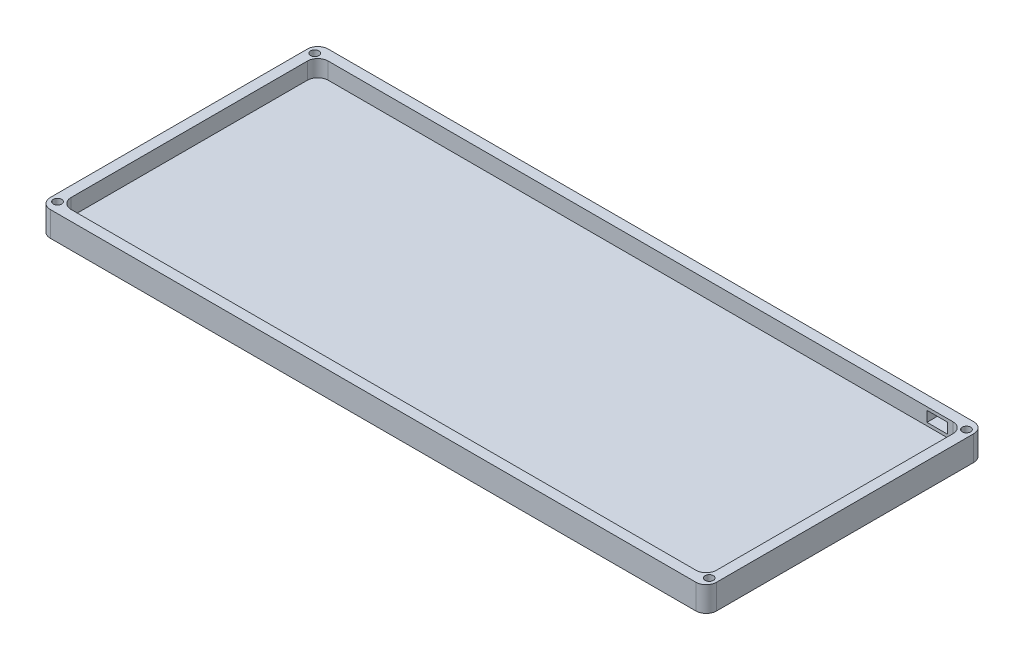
ISO-10303-21;
HEADER;
FILE_DESCRIPTION(('STEP AP214'),'2;1');
FILE_NAME('part.step','',(''),(''),'','','');
FILE_SCHEMA(('AUTOMOTIVE_DESIGN { 1 0 10303 214 1 1 1 1 }'));
ENDSEC;
DATA;
#1=APPLICATION_CONTEXT('core data for automotive mechanical design processes');
#2=APPLICATION_PROTOCOL_DEFINITION('international standard','automotive_design',2000,#1);
#3=PRODUCT_CONTEXT('',#1,'mechanical');
#4=PRODUCT('Part','Part','',(#3));
#5=PRODUCT_RELATED_PRODUCT_CATEGORY('part','',(#4));
#6=PRODUCT_DEFINITION_FORMATION('','',#4);
#7=PRODUCT_DEFINITION_CONTEXT('part definition',#1,'design');
#8=PRODUCT_DEFINITION('design','',#6,#7);
#9=PRODUCT_DEFINITION_SHAPE('','',#8);
#10=(LENGTH_UNIT() NAMED_UNIT(*) SI_UNIT(.MILLI.,.METRE.));
#11=(NAMED_UNIT(*) PLANE_ANGLE_UNIT() SI_UNIT($,.RADIAN.));
#12=(NAMED_UNIT(*) SI_UNIT($,.STERADIAN.) SOLID_ANGLE_UNIT());
#13=UNCERTAINTY_MEASURE_WITH_UNIT(LENGTH_MEASURE(1.E-05),#10,'distance_accuracy_value','');
#14=(GEOMETRIC_REPRESENTATION_CONTEXT(3) GLOBAL_UNCERTAINTY_ASSIGNED_CONTEXT((#13)) GLOBAL_UNIT_ASSIGNED_CONTEXT((#10,
#11,#12)) REPRESENTATION_CONTEXT('',''));
#15=CARTESIAN_POINT('',(0.,0.,0.));
#16=DIRECTION('',(0.,0.,1.));
#17=DIRECTION('',(1.,0.,0.));
#18=AXIS2_PLACEMENT_3D('',#15,#16,#17);
#19=CARTESIAN_POINT('',(0.,12.,-61.8375));
#20=DIRECTION('',(0.,0.,-1.));
#21=DIRECTION('',(-1.,0.,0.));
#22=AXIS2_PLACEMENT_3D('',#19,#20,#21);
#23=PLANE('',#22);
#24=DIRECTION('',(1.,0.,0.));
#25=VECTOR('',#24,1.);
#26=CARTESIAN_POINT('',(0.,10.5000000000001,-61.8375));
#27=LINE('',#26,#25);
#28=CARTESIAN_POINT('',(137.75,10.5,-61.8375));
#29=VERTEX_POINT('',#28);
#30=CARTESIAN_POINT('',(147.75,10.5,-61.8375));
#31=VERTEX_POINT('',#30);
#32=EDGE_CURVE('E210',#29,#31,#27,.T.);
#33=ORIENTED_EDGE('',*,*,#32,.T.);
#34=DIRECTION('',(0.,-1.,0.));
#35=VECTOR('',#34,1.);
#36=CARTESIAN_POINT('',(147.75,12.,-61.8375));
#37=LINE('',#36,#35);
#38=CARTESIAN_POINT('',(147.75,5.5,-61.8375));
#39=VERTEX_POINT('',#38);
#40=EDGE_CURVE('E213',#31,#39,#37,.T.);
#41=ORIENTED_EDGE('',*,*,#40,.T.);
#42=DIRECTION('',(-1.,0.,0.));
#43=VECTOR('',#42,1.);
#44=CARTESIAN_POINT('',(0.,5.50000000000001,-61.8375));
#45=LINE('',#44,#43);
#46=CARTESIAN_POINT('',(137.75,5.5,-61.8375));
#47=VERTEX_POINT('',#46);
#48=EDGE_CURVE('E205',#39,#47,#45,.T.);
#49=ORIENTED_EDGE('',*,*,#48,.T.);
#50=DIRECTION('',(0.,1.,0.));
#51=VECTOR('',#50,1.);
#52=CARTESIAN_POINT('',(137.75,12.,-61.8375));
#53=LINE('',#52,#51);
#54=EDGE_CURVE('E185',#47,#29,#53,.T.);
#55=ORIENTED_EDGE('',*,*,#54,.T.);
#56=EDGE_LOOP('',(#33,#41,#49,#55));
#57=FACE_BOUND('',#56,.T.);
#58=DIRECTION('',(1.,0.,0.));
#59=VECTOR('',#58,1.);
#60=CARTESIAN_POINT('',(0.,4.,-61.8375));
#61=LINE('',#60,#59);
#62=CARTESIAN_POINT('',(-150.25,4.,-61.8375));
#63=VERTEX_POINT('',#62);
#64=CARTESIAN_POINT('',(150.25,4.,-61.8375));
#65=VERTEX_POINT('',#64);
#66=EDGE_CURVE('E232',#63,#65,#61,.T.);
#67=ORIENTED_EDGE('',*,*,#66,.T.);
#68=DIRECTION('',(0.,-1.,0.));
#69=VECTOR('',#68,1.);
#70=CARTESIAN_POINT('',(150.25,12.,-61.8375));
#71=LINE('',#70,#69);
#72=CARTESIAN_POINT('',(150.25,12.,-61.8375));
#73=VERTEX_POINT('',#72);
#74=EDGE_CURVE('E303',#65,#73,#71,.F.);
#75=ORIENTED_EDGE('',*,*,#74,.T.);
#76=DIRECTION('',(1.,0.,0.));
#77=VECTOR('',#76,1.);
#78=CARTESIAN_POINT('',(0.,12.,-61.8375));
#79=LINE('',#78,#77);
#80=CARTESIAN_POINT('',(-150.25,12.,-61.8375));
#81=VERTEX_POINT('',#80);
#82=EDGE_CURVE('E255',#81,#73,#79,.T.);
#83=ORIENTED_EDGE('',*,*,#82,.F.);
#84=DIRECTION('',(0.,-1.,0.));
#85=VECTOR('',#84,1.);
#86=CARTESIAN_POINT('',(-150.25,12.,-61.8375));
#87=LINE('',#86,#85);
#88=EDGE_CURVE('E300',#81,#63,#87,.T.);
#89=ORIENTED_EDGE('',*,*,#88,.T.);
#90=EDGE_LOOP('',(#67,#75,#83,#89));
#91=FACE_BOUND('',#90,.T.);
#92=ADVANCED_FACE('F41',(#57,#91),#23,.F.);
#93=CARTESIAN_POINT('',(155.25,12.,0.));
#94=DIRECTION('',(1.,0.,0.));
#95=DIRECTION('',(0.,0.,-1.));
#96=AXIS2_PLACEMENT_3D('',#93,#94,#95);
#97=PLANE('',#96);
#98=DIRECTION('',(0.,0.,1.));
#99=VECTOR('',#98,1.);
#100=CARTESIAN_POINT('',(155.25,4.,0.));
#101=LINE('',#100,#99);
#102=CARTESIAN_POINT('',(155.25,4.,-56.8375));
#103=VERTEX_POINT('',#102);
#104=CARTESIAN_POINT('',(155.25,4.,56.8375));
#105=VERTEX_POINT('',#104);
#106=EDGE_CURVE('E229',#103,#105,#101,.T.);
#107=ORIENTED_EDGE('',*,*,#106,.T.);
#108=DIRECTION('',(0.,-1.,0.));
#109=VECTOR('',#108,1.);
#110=CARTESIAN_POINT('',(155.25,12.,56.8375));
#111=LINE('',#110,#109);
#112=CARTESIAN_POINT('',(155.25,12.,56.8375));
#113=VERTEX_POINT('',#112);
#114=EDGE_CURVE('E298',#105,#113,#111,.F.);
#115=ORIENTED_EDGE('',*,*,#114,.T.);
#116=DIRECTION('',(0.,0.,1.));
#117=VECTOR('',#116,1.);
#118=CARTESIAN_POINT('',(155.25,12.,0.));
#119=LINE('',#118,#117);
#120=CARTESIAN_POINT('',(155.25,12.,-56.8375));
#121=VERTEX_POINT('',#120);
#122=EDGE_CURVE('E258',#121,#113,#119,.T.);
#123=ORIENTED_EDGE('',*,*,#122,.F.);
#124=DIRECTION('',(0.,-1.,0.));
#125=VECTOR('',#124,1.);
#126=CARTESIAN_POINT('',(155.25,4.,-56.8375));
#127=LINE('',#126,#125);
#128=EDGE_CURVE('E295',#121,#103,#127,.T.);
#129=ORIENTED_EDGE('',*,*,#128,.T.);
#130=EDGE_LOOP('',(#107,#115,#123,#129));
#131=FACE_BOUND('',#130,.T.);
#132=ADVANCED_FACE('F376',(#131),#97,.F.);
#133=CARTESIAN_POINT('',(0.,12.,61.8375));
#134=DIRECTION('',(0.,0.,-1.));
#135=DIRECTION('',(-1.,0.,0.));
#136=AXIS2_PLACEMENT_3D('',#133,#134,#135);
#137=PLANE('',#136);
#138=DIRECTION('',(1.,0.,0.));
#139=VECTOR('',#138,1.);
#140=CARTESIAN_POINT('',(0.,4.,61.8375));
#141=LINE('',#140,#139);
#142=CARTESIAN_POINT('',(-150.25,4.,61.8375));
#143=VERTEX_POINT('',#142);
#144=CARTESIAN_POINT('',(150.25,4.,61.8375));
#145=VERTEX_POINT('',#144);
#146=EDGE_CURVE('E238',#143,#145,#141,.T.);
#147=ORIENTED_EDGE('',*,*,#146,.F.);
#148=DIRECTION('',(0.,-1.,0.));
#149=VECTOR('',#148,1.);
#150=CARTESIAN_POINT('',(-150.25,12.,61.8375));
#151=LINE('',#150,#149);
#152=CARTESIAN_POINT('',(-150.25,12.,61.8375));
#153=VERTEX_POINT('',#152);
#154=EDGE_CURVE('E293',#143,#153,#151,.F.);
#155=ORIENTED_EDGE('',*,*,#154,.T.);
#156=DIRECTION('',(1.,0.,0.));
#157=VECTOR('',#156,1.);
#158=CARTESIAN_POINT('',(0.,12.,61.8375));
#159=LINE('',#158,#157);
#160=CARTESIAN_POINT('',(150.25,12.,61.8375));
#161=VERTEX_POINT('',#160);
#162=EDGE_CURVE('E261',#153,#161,#159,.T.);
#163=ORIENTED_EDGE('',*,*,#162,.T.);
#164=DIRECTION('',(0.,-1.,0.));
#165=VECTOR('',#164,1.);
#166=CARTESIAN_POINT('',(150.25,12.,61.8375));
#167=LINE('',#166,#165);
#168=EDGE_CURVE('E290',#161,#145,#167,.T.);
#169=ORIENTED_EDGE('',*,*,#168,.T.);
#170=EDGE_LOOP('',(#147,#155,#163,#169));
#171=FACE_BOUND('',#170,.T.);
#172=ADVANCED_FACE('F383',(#171),#137,.T.);
#173=CARTESIAN_POINT('',(0.,12.,-66.8375));
#174=DIRECTION('',(0.,0.,-1.));
#175=DIRECTION('',(-1.,0.,0.));
#176=AXIS2_PLACEMENT_3D('',#173,#174,#175);
#177=PLANE('',#176);
#178=DIRECTION('',(0.,-1.,0.));
#179=VECTOR('',#178,1.);
#180=CARTESIAN_POINT('',(147.75,5.5,-66.8375));
#181=LINE('',#180,#179);
#182=CARTESIAN_POINT('',(147.75,10.5,-66.8375));
#183=VERTEX_POINT('',#182);
#184=CARTESIAN_POINT('',(147.75,5.5,-66.8375));
#185=VERTEX_POINT('',#184);
#186=EDGE_CURVE('E66',#183,#185,#181,.T.);
#187=ORIENTED_EDGE('',*,*,#186,.F.);
#188=DIRECTION('',(1.,0.,0.));
#189=VECTOR('',#188,1.);
#190=CARTESIAN_POINT('',(137.75,10.5,-66.8375));
#191=LINE('',#190,#189);
#192=CARTESIAN_POINT('',(137.75,10.5,-66.8375));
#193=VERTEX_POINT('',#192);
#194=EDGE_CURVE('E198',#193,#183,#191,.T.);
#195=ORIENTED_EDGE('',*,*,#194,.F.);
#196=DIRECTION('',(0.,1.,0.));
#197=VECTOR('',#196,1.);
#198=CARTESIAN_POINT('',(137.75,5.5,-66.8375));
#199=LINE('',#198,#197);
#200=CARTESIAN_POINT('',(137.75,5.5,-66.8375));
#201=VERTEX_POINT('',#200);
#202=EDGE_CURVE('E182',#201,#193,#199,.T.);
#203=ORIENTED_EDGE('',*,*,#202,.F.);
#204=DIRECTION('',(-1.,0.,0.));
#205=VECTOR('',#204,1.);
#206=CARTESIAN_POINT('',(137.75,5.5,-66.8375));
#207=LINE('',#206,#205);
#208=EDGE_CURVE('E191',#185,#201,#207,.T.);
#209=ORIENTED_EDGE('',*,*,#208,.F.);
#210=EDGE_LOOP('',(#187,#195,#203,#209));
#211=FACE_BOUND('',#210,.T.);
#212=DIRECTION('',(1.,0.,0.));
#213=VECTOR('',#212,1.);
#214=CARTESIAN_POINT('',(0.,12.,-66.8375));
#215=LINE('',#214,#213);
#216=CARTESIAN_POINT('',(-155.25,12.,-66.8375));
#217=VERTEX_POINT('',#216);
#218=CARTESIAN_POINT('',(155.25,12.,-66.8375));
#219=VERTEX_POINT('',#218);
#220=EDGE_CURVE('E242',#217,#219,#215,.T.);
#221=ORIENTED_EDGE('',*,*,#220,.T.);
#222=DIRECTION('',(0.,-1.,0.));
#223=VECTOR('',#222,1.);
#224=CARTESIAN_POINT('',(155.25,12.,-66.8375));
#225=LINE('',#224,#223);
#226=CARTESIAN_POINT('',(155.25,0.,-66.8375));
#227=VERTEX_POINT('',#226);
#228=EDGE_CURVE('E333',#219,#227,#225,.T.);
#229=ORIENTED_EDGE('',*,*,#228,.T.);
#230=DIRECTION('',(1.,0.,0.));
#231=VECTOR('',#230,1.);
#232=CARTESIAN_POINT('',(0.,0.,-66.8375));
#233=LINE('',#232,#231);
#234=CARTESIAN_POINT('',(-155.25,0.,-66.8375));
#235=VERTEX_POINT('',#234);
#236=EDGE_CURVE('E241',#235,#227,#233,.T.);
#237=ORIENTED_EDGE('',*,*,#236,.F.);
#238=DIRECTION('',(0.,-1.,0.));
#239=VECTOR('',#238,1.);
#240=CARTESIAN_POINT('',(-155.25,12.,-66.8375));
#241=LINE('',#240,#239);
#242=EDGE_CURVE('E331',#235,#217,#241,.F.);
#243=ORIENTED_EDGE('',*,*,#242,.T.);
#244=EDGE_LOOP('',(#221,#229,#237,#243));
#245=FACE_BOUND('',#244,.T.);
#246=ADVANCED_FACE('F195',(#211,#245),#177,.T.);
#247=CARTESIAN_POINT('',(-160.25,12.,0.));
#248=DIRECTION('',(1.,0.,0.));
#249=DIRECTION('',(0.,0.,-1.));
#250=AXIS2_PLACEMENT_3D('',#247,#248,#249);
#251=PLANE('',#250);
#252=DIRECTION('',(0.,0.,1.));
#253=VECTOR('',#252,1.);
#254=CARTESIAN_POINT('',(-160.25,12.,0.));
#255=LINE('',#254,#253);
#256=CARTESIAN_POINT('',(-160.25,12.,-61.8375));
#257=VERTEX_POINT('',#256);
#258=CARTESIAN_POINT('',(-160.25,12.,61.8375));
#259=VERTEX_POINT('',#258);
#260=EDGE_CURVE('E245',#257,#259,#255,.T.);
#261=ORIENTED_EDGE('',*,*,#260,.F.);
#262=DIRECTION('',(0.,-1.,0.));
#263=VECTOR('',#262,1.);
#264=CARTESIAN_POINT('',(-160.25,0.,-61.8375));
#265=LINE('',#264,#263);
#266=CARTESIAN_POINT('',(-160.25,0.,-61.8375));
#267=VERTEX_POINT('',#266);
#268=EDGE_CURVE('E338',#257,#267,#265,.T.);
#269=ORIENTED_EDGE('',*,*,#268,.T.);
#270=DIRECTION('',(0.,0.,1.));
#271=VECTOR('',#270,1.);
#272=CARTESIAN_POINT('',(-160.25,0.,0.));
#273=LINE('',#272,#271);
#274=CARTESIAN_POINT('',(-160.25,0.,61.8375));
#275=VERTEX_POINT('',#274);
#276=EDGE_CURVE('E270',#267,#275,#273,.T.);
#277=ORIENTED_EDGE('',*,*,#276,.T.);
#278=DIRECTION('',(0.,-1.,0.));
#279=VECTOR('',#278,1.);
#280=CARTESIAN_POINT('',(-160.25,12.,61.8375));
#281=LINE('',#280,#279);
#282=EDGE_CURVE('E336',#275,#259,#281,.F.);
#283=ORIENTED_EDGE('',*,*,#282,.T.);
#284=EDGE_LOOP('',(#261,#269,#277,#283));
#285=FACE_BOUND('',#284,.T.);
#286=ADVANCED_FACE('F397',(#285),#251,.F.);
#287=CARTESIAN_POINT('',(0.,12.,66.8375));
#288=DIRECTION('',(0.,0.,-1.));
#289=DIRECTION('',(-1.,0.,0.));
#290=AXIS2_PLACEMENT_3D('',#287,#288,#289);
#291=PLANE('',#290);
#292=DIRECTION('',(1.,0.,0.));
#293=VECTOR('',#292,1.);
#294=CARTESIAN_POINT('',(0.,0.,66.8375));
#295=LINE('',#294,#293);
#296=CARTESIAN_POINT('',(-155.25,0.,66.8375));
#297=VERTEX_POINT('',#296);
#298=CARTESIAN_POINT('',(155.25,0.,66.8375));
#299=VERTEX_POINT('',#298);
#300=EDGE_CURVE('E273',#297,#299,#295,.T.);
#301=ORIENTED_EDGE('',*,*,#300,.T.);
#302=DIRECTION('',(0.,-1.,0.));
#303=VECTOR('',#302,1.);
#304=CARTESIAN_POINT('',(155.25,12.,66.8375));
#305=LINE('',#304,#303);
#306=CARTESIAN_POINT('',(155.25,12.,66.8375));
#307=VERTEX_POINT('',#306);
#308=EDGE_CURVE('E321',#299,#307,#305,.F.);
#309=ORIENTED_EDGE('',*,*,#308,.T.);
#310=DIRECTION('',(1.,0.,0.));
#311=VECTOR('',#310,1.);
#312=CARTESIAN_POINT('',(0.,12.,66.8375));
#313=LINE('',#312,#311);
#314=CARTESIAN_POINT('',(-155.25,12.,66.8375));
#315=VERTEX_POINT('',#314);
#316=EDGE_CURVE('E249',#315,#307,#313,.T.);
#317=ORIENTED_EDGE('',*,*,#316,.F.);
#318=DIRECTION('',(0.,-1.,0.));
#319=VECTOR('',#318,1.);
#320=CARTESIAN_POINT('',(-155.25,12.,66.8375));
#321=LINE('',#320,#319);
#322=EDGE_CURVE('E318',#315,#297,#321,.T.);
#323=ORIENTED_EDGE('',*,*,#322,.T.);
#324=EDGE_LOOP('',(#301,#309,#317,#323));
#325=FACE_BOUND('',#324,.T.);
#326=ADVANCED_FACE('F393',(#325),#291,.F.);
#327=CARTESIAN_POINT('',(160.25,12.,0.));
#328=DIRECTION('',(1.,0.,0.));
#329=DIRECTION('',(0.,0.,-1.));
#330=AXIS2_PLACEMENT_3D('',#327,#328,#329);
#331=PLANE('',#330);
#332=DIRECTION('',(0.,0.,1.));
#333=VECTOR('',#332,1.);
#334=CARTESIAN_POINT('',(160.25,12.,0.));
#335=LINE('',#334,#333);
#336=CARTESIAN_POINT('',(160.25,12.,-61.8375));
#337=VERTEX_POINT('',#336);
#338=CARTESIAN_POINT('',(160.25,12.,61.8375));
#339=VERTEX_POINT('',#338);
#340=EDGE_CURVE('E252',#337,#339,#335,.T.);
#341=ORIENTED_EDGE('',*,*,#340,.T.);
#342=DIRECTION('',(0.,-1.,0.));
#343=VECTOR('',#342,1.);
#344=CARTESIAN_POINT('',(160.25,0.,61.8375));
#345=LINE('',#344,#343);
#346=CARTESIAN_POINT('',(160.25,0.,61.8375));
#347=VERTEX_POINT('',#346);
#348=EDGE_CURVE('E307',#339,#347,#345,.T.);
#349=ORIENTED_EDGE('',*,*,#348,.T.);
#350=DIRECTION('',(0.,0.,1.));
#351=VECTOR('',#350,1.);
#352=CARTESIAN_POINT('',(160.25,0.,0.));
#353=LINE('',#352,#351);
#354=CARTESIAN_POINT('',(160.25,0.,-61.8375));
#355=VERTEX_POINT('',#354);
#356=EDGE_CURVE('E246',#355,#347,#353,.T.);
#357=ORIENTED_EDGE('',*,*,#356,.F.);
#358=DIRECTION('',(0.,-1.,0.));
#359=VECTOR('',#358,1.);
#360=CARTESIAN_POINT('',(160.25,12.,-61.8375));
#361=LINE('',#360,#359);
#362=EDGE_CURVE('E305',#355,#337,#361,.F.);
#363=ORIENTED_EDGE('',*,*,#362,.T.);
#364=EDGE_LOOP('',(#341,#349,#357,#363));
#365=FACE_BOUND('',#364,.T.);
#366=ADVANCED_FACE('F389',(#365),#331,.T.);
#367=CARTESIAN_POINT('',(-155.25,12.,0.));
#368=DIRECTION('',(1.,0.,0.));
#369=DIRECTION('',(0.,0.,-1.));
#370=AXIS2_PLACEMENT_3D('',#367,#368,#369);
#371=PLANE('',#370);
#372=DIRECTION('',(0.,0.,1.));
#373=VECTOR('',#372,1.);
#374=CARTESIAN_POINT('',(-155.25,12.,0.));
#375=LINE('',#374,#373);
#376=CARTESIAN_POINT('',(-155.25,12.,-56.8375));
#377=VERTEX_POINT('',#376);
#378=CARTESIAN_POINT('',(-155.25,12.,56.8375));
#379=VERTEX_POINT('',#378);
#380=EDGE_CURVE('E264',#377,#379,#375,.T.);
#381=ORIENTED_EDGE('',*,*,#380,.T.);
#382=DIRECTION('',(0.,-1.,0.));
#383=VECTOR('',#382,1.);
#384=CARTESIAN_POINT('',(-155.25,4.,56.8375));
#385=LINE('',#384,#383);
#386=CARTESIAN_POINT('',(-155.25,4.,56.8375));
#387=VERTEX_POINT('',#386);
#388=EDGE_CURVE('E279',#379,#387,#385,.T.);
#389=ORIENTED_EDGE('',*,*,#388,.T.);
#390=DIRECTION('',(0.,0.,1.));
#391=VECTOR('',#390,1.);
#392=CARTESIAN_POINT('',(-155.25,4.,0.));
#393=LINE('',#392,#391);
#394=CARTESIAN_POINT('',(-155.25,4.,-56.8375));
#395=VERTEX_POINT('',#394);
#396=EDGE_CURVE('E235',#395,#387,#393,.T.);
#397=ORIENTED_EDGE('',*,*,#396,.F.);
#398=DIRECTION('',(0.,-1.,0.));
#399=VECTOR('',#398,1.);
#400=CARTESIAN_POINT('',(-155.25,12.,-56.8375));
#401=LINE('',#400,#399);
#402=EDGE_CURVE('E267',#395,#377,#401,.F.);
#403=ORIENTED_EDGE('',*,*,#402,.T.);
#404=EDGE_LOOP('',(#381,#389,#397,#403));
#405=FACE_BOUND('',#404,.T.);
#406=ADVANCED_FACE('F392',(#405),#371,.T.);
#407=CARTESIAN_POINT('',(0.,12.,0.));
#408=DIRECTION('',(0.,1.,0.));
#409=DIRECTION('',(0.,0.,1.));
#410=AXIS2_PLACEMENT_3D('',#407,#408,#409);
#411=PLANE('',#410);
#412=CARTESIAN_POINT('',(156.75,12.,-61.8375));
#413=DIRECTION('',(0.,1.,0.));
#414=DIRECTION('',(0.,0.,1.));
#415=AXIS2_PLACEMENT_3D('',#412,#413,#414);
#416=CIRCLE('',#415,2.);
#417=CARTESIAN_POINT('',(156.75,12.,-59.8375));
#418=VERTEX_POINT('',#417);
#419=EDGE_CURVE('E220',#418,#418,#416,.T.);
#420=ORIENTED_EDGE('',*,*,#419,.F.);
#421=EDGE_LOOP('',(#420));
#422=FACE_BOUND('',#421,.T.);
#423=CARTESIAN_POINT('',(-156.749999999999,12.,61.8625));
#424=DIRECTION('',(0.,1.,0.));
#425=DIRECTION('',(0.,0.,1.));
#426=AXIS2_PLACEMENT_3D('',#423,#424,#425);
#427=CIRCLE('',#426,2.);
#428=CARTESIAN_POINT('',(-156.749999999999,12.,63.8625));
#429=VERTEX_POINT('',#428);
#430=EDGE_CURVE('E219',#429,#429,#427,.T.);
#431=ORIENTED_EDGE('',*,*,#430,.F.);
#432=EDGE_LOOP('',(#431));
#433=FACE_BOUND('',#432,.T.);
#434=CARTESIAN_POINT('',(156.750000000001,12.,61.8625));
#435=DIRECTION('',(0.,1.,0.));
#436=DIRECTION('',(0.,0.,1.));
#437=AXIS2_PLACEMENT_3D('',#434,#435,#436);
#438=CIRCLE('',#437,2.);
#439=CARTESIAN_POINT('',(156.750000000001,12.,63.8625));
#440=VERTEX_POINT('',#439);
#441=EDGE_CURVE('E216',#440,#440,#438,.T.);
#442=ORIENTED_EDGE('',*,*,#441,.F.);
#443=EDGE_LOOP('',(#442));
#444=FACE_BOUND('',#443,.T.);
#445=CARTESIAN_POINT('',(-156.75,12.,-61.8375));
#446=DIRECTION('',(0.,1.,0.));
#447=DIRECTION('',(0.,0.,1.));
#448=AXIS2_PLACEMENT_3D('',#445,#446,#447);
#449=CIRCLE('',#448,2.);
#450=CARTESIAN_POINT('',(-156.75,12.,-59.8375));
#451=VERTEX_POINT('',#450);
#452=EDGE_CURVE('E223',#451,#451,#449,.T.);
#453=ORIENTED_EDGE('',*,*,#452,.F.);
#454=EDGE_LOOP('',(#453));
#455=FACE_BOUND('',#454,.T.);
#456=ORIENTED_EDGE('',*,*,#316,.T.);
#457=CARTESIAN_POINT('',(155.25,12.,61.8375));
#458=DIRECTION('',(0.,1.,0.));
#459=DIRECTION('',(0.,0.,1.));
#460=AXIS2_PLACEMENT_3D('',#457,#458,#459);
#461=CIRCLE('',#460,5.);
#462=EDGE_CURVE('E329',#307,#339,#461,.T.);
#463=ORIENTED_EDGE('',*,*,#462,.T.);
#464=ORIENTED_EDGE('',*,*,#340,.F.);
#465=CARTESIAN_POINT('',(155.25,12.,-61.8375));
#466=DIRECTION('',(0.,1.,0.));
#467=DIRECTION('',(0.,0.,1.));
#468=AXIS2_PLACEMENT_3D('',#465,#466,#467);
#469=CIRCLE('',#468,5.);
#470=EDGE_CURVE('E327',#337,#219,#469,.T.);
#471=ORIENTED_EDGE('',*,*,#470,.T.);
#472=ORIENTED_EDGE('',*,*,#220,.F.);
#473=CARTESIAN_POINT('',(-155.25,12.,-61.8375));
#474=DIRECTION('',(0.,1.,0.));
#475=DIRECTION('',(0.,0.,1.));
#476=AXIS2_PLACEMENT_3D('',#473,#474,#475);
#477=CIRCLE('',#476,5.);
#478=EDGE_CURVE('E325',#217,#257,#477,.T.);
#479=ORIENTED_EDGE('',*,*,#478,.T.);
#480=ORIENTED_EDGE('',*,*,#260,.T.);
#481=CARTESIAN_POINT('',(-155.25,12.,61.8375));
#482=DIRECTION('',(0.,1.,0.));
#483=DIRECTION('',(0.,0.,1.));
#484=AXIS2_PLACEMENT_3D('',#481,#482,#483);
#485=CIRCLE('',#484,5.);
#486=EDGE_CURVE('E323',#259,#315,#485,.T.);
#487=ORIENTED_EDGE('',*,*,#486,.T.);
#488=EDGE_LOOP('',(#456,#463,#464,#471,#472,#479,#480,#487));
#489=FACE_BOUND('',#488,.T.);
#490=ORIENTED_EDGE('',*,*,#380,.F.);
#491=CARTESIAN_POINT('',(-150.25,12.,-56.8375));
#492=DIRECTION('',(0.,1.,0.));
#493=DIRECTION('',(0.,0.,1.));
#494=AXIS2_PLACEMENT_3D('',#491,#492,#493);
#495=CIRCLE('',#494,5.);
#496=EDGE_CURVE('E11',#377,#81,#495,.F.);
#497=ORIENTED_EDGE('',*,*,#496,.T.);
#498=ORIENTED_EDGE('',*,*,#82,.T.);
#499=CARTESIAN_POINT('',(150.25,12.,-56.8375));
#500=DIRECTION('',(0.,1.,0.));
#501=DIRECTION('',(0.,0.,1.));
#502=AXIS2_PLACEMENT_3D('',#499,#500,#501);
#503=CIRCLE('',#502,5.);
#504=EDGE_CURVE('E50',#73,#121,#503,.F.);
#505=ORIENTED_EDGE('',*,*,#504,.T.);
#506=ORIENTED_EDGE('',*,*,#122,.T.);
#507=CARTESIAN_POINT('',(150.25,12.,56.8375));
#508=DIRECTION('',(0.,1.,0.));
#509=DIRECTION('',(0.,0.,1.));
#510=AXIS2_PLACEMENT_3D('',#507,#508,#509);
#511=CIRCLE('',#510,5.);
#512=EDGE_CURVE('E343',#113,#161,#511,.F.);
#513=ORIENTED_EDGE('',*,*,#512,.T.);
#514=ORIENTED_EDGE('',*,*,#162,.F.);
#515=CARTESIAN_POINT('',(-150.25,12.,56.8375));
#516=DIRECTION('',(0.,1.,0.));
#517=DIRECTION('',(0.,0.,1.));
#518=AXIS2_PLACEMENT_3D('',#515,#516,#517);
#519=CIRCLE('',#518,5.);
#520=EDGE_CURVE('E341',#153,#379,#519,.F.);
#521=ORIENTED_EDGE('',*,*,#520,.T.);
#522=EDGE_LOOP('',(#490,#497,#498,#505,#506,#513,#514,#521));
#523=FACE_BOUND('',#522,.T.);
#524=ADVANCED_FACE('F441',(#422,#433,#444,#455,#489,#523),#411,.T.);
#525=CARTESIAN_POINT('',(0.,0.,0.));
#526=DIRECTION('',(0.,1.,0.));
#527=DIRECTION('',(0.,0.,1.));
#528=AXIS2_PLACEMENT_3D('',#525,#526,#527);
#529=PLANE('',#528);
#530=CARTESIAN_POINT('',(156.75,0.,-61.8375));
#531=DIRECTION('',(0.,1.,0.));
#532=DIRECTION('',(0.,0.,1.));
#533=AXIS2_PLACEMENT_3D('',#530,#531,#532);
#534=CIRCLE('',#533,2.);
#535=CARTESIAN_POINT('',(156.75,0.,-59.8375));
#536=VERTEX_POINT('',#535);
#537=EDGE_CURVE('E45',#536,#536,#534,.T.);
#538=ORIENTED_EDGE('',*,*,#537,.T.);
#539=EDGE_LOOP('',(#538));
#540=FACE_BOUND('',#539,.T.);
#541=CARTESIAN_POINT('',(-156.749999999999,0.,61.8625));
#542=DIRECTION('',(0.,1.,0.));
#543=DIRECTION('',(0.,0.,1.));
#544=AXIS2_PLACEMENT_3D('',#541,#542,#543);
#545=CIRCLE('',#544,2.);
#546=CARTESIAN_POINT('',(-156.749999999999,0.,63.8625));
#547=VERTEX_POINT('',#546);
#548=EDGE_CURVE('E350',#547,#547,#545,.T.);
#549=ORIENTED_EDGE('',*,*,#548,.T.);
#550=EDGE_LOOP('',(#549));
#551=FACE_BOUND('',#550,.T.);
#552=CARTESIAN_POINT('',(156.750000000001,0.,61.8625));
#553=DIRECTION('',(0.,1.,0.));
#554=DIRECTION('',(0.,0.,1.));
#555=AXIS2_PLACEMENT_3D('',#552,#553,#554);
#556=CIRCLE('',#555,2.);
#557=CARTESIAN_POINT('',(156.750000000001,0.,63.8625));
#558=VERTEX_POINT('',#557);
#559=EDGE_CURVE('E348',#558,#558,#556,.T.);
#560=ORIENTED_EDGE('',*,*,#559,.T.);
#561=EDGE_LOOP('',(#560));
#562=FACE_BOUND('',#561,.T.);
#563=CARTESIAN_POINT('',(-156.75,0.,-61.8375));
#564=DIRECTION('',(0.,1.,0.));
#565=DIRECTION('',(0.,0.,1.));
#566=AXIS2_PLACEMENT_3D('',#563,#564,#565);
#567=CIRCLE('',#566,2.);
#568=CARTESIAN_POINT('',(-156.75,0.,-59.8375));
#569=VERTEX_POINT('',#568);
#570=EDGE_CURVE('E228',#569,#569,#567,.T.);
#571=ORIENTED_EDGE('',*,*,#570,.T.);
#572=EDGE_LOOP('',(#571));
#573=FACE_BOUND('',#572,.T.);
#574=ORIENTED_EDGE('',*,*,#356,.T.);
#575=CARTESIAN_POINT('',(155.25,0.,61.8375));
#576=DIRECTION('',(0.,1.,0.));
#577=DIRECTION('',(0.,0.,1.));
#578=AXIS2_PLACEMENT_3D('',#575,#576,#577);
#579=CIRCLE('',#578,5.);
#580=EDGE_CURVE('E316',#347,#299,#579,.F.);
#581=ORIENTED_EDGE('',*,*,#580,.T.);
#582=ORIENTED_EDGE('',*,*,#300,.F.);
#583=CARTESIAN_POINT('',(-155.25,0.,61.8375));
#584=DIRECTION('',(0.,1.,0.));
#585=DIRECTION('',(0.,0.,1.));
#586=AXIS2_PLACEMENT_3D('',#583,#584,#585);
#587=CIRCLE('',#586,5.);
#588=EDGE_CURVE('E310',#297,#275,#587,.F.);
#589=ORIENTED_EDGE('',*,*,#588,.T.);
#590=ORIENTED_EDGE('',*,*,#276,.F.);
#591=CARTESIAN_POINT('',(-155.25,0.,-61.8375));
#592=DIRECTION('',(0.,1.,0.));
#593=DIRECTION('',(0.,0.,1.));
#594=AXIS2_PLACEMENT_3D('',#591,#592,#593);
#595=CIRCLE('',#594,5.);
#596=EDGE_CURVE('E312',#267,#235,#595,.F.);
#597=ORIENTED_EDGE('',*,*,#596,.T.);
#598=ORIENTED_EDGE('',*,*,#236,.T.);
#599=CARTESIAN_POINT('',(155.25,0.,-61.8375));
#600=DIRECTION('',(0.,1.,0.));
#601=DIRECTION('',(0.,0.,1.));
#602=AXIS2_PLACEMENT_3D('',#599,#600,#601);
#603=CIRCLE('',#602,5.);
#604=EDGE_CURVE('E314',#227,#355,#603,.F.);
#605=ORIENTED_EDGE('',*,*,#604,.T.);
#606=EDGE_LOOP('',(#574,#581,#582,#589,#590,#597,#598,#605));
#607=FACE_BOUND('',#606,.T.);
#608=ADVANCED_FACE('F357',(#540,#551,#562,#573,#607),#529,.F.);
#609=CARTESIAN_POINT('',(0.,4.,0.));
#610=DIRECTION('',(0.,1.,0.));
#611=DIRECTION('',(0.,0.,1.));
#612=AXIS2_PLACEMENT_3D('',#609,#610,#611);
#613=PLANE('',#612);
#614=ORIENTED_EDGE('',*,*,#396,.T.);
#615=CARTESIAN_POINT('',(-150.25,4.,56.8375));
#616=DIRECTION('',(0.,1.,0.));
#617=DIRECTION('',(0.,0.,1.));
#618=AXIS2_PLACEMENT_3D('',#615,#616,#617);
#619=CIRCLE('',#618,5.);
#620=EDGE_CURVE('E288',#387,#143,#619,.T.);
#621=ORIENTED_EDGE('',*,*,#620,.T.);
#622=ORIENTED_EDGE('',*,*,#146,.T.);
#623=CARTESIAN_POINT('',(150.25,4.,56.8375));
#624=DIRECTION('',(0.,1.,0.));
#625=DIRECTION('',(0.,0.,1.));
#626=AXIS2_PLACEMENT_3D('',#623,#624,#625);
#627=CIRCLE('',#626,5.);
#628=EDGE_CURVE('E286',#145,#105,#627,.T.);
#629=ORIENTED_EDGE('',*,*,#628,.T.);
#630=ORIENTED_EDGE('',*,*,#106,.F.);
#631=CARTESIAN_POINT('',(150.25,4.,-56.8375));
#632=DIRECTION('',(0.,1.,0.));
#633=DIRECTION('',(0.,0.,1.));
#634=AXIS2_PLACEMENT_3D('',#631,#632,#633);
#635=CIRCLE('',#634,5.);
#636=EDGE_CURVE('E284',#103,#65,#635,.T.);
#637=ORIENTED_EDGE('',*,*,#636,.T.);
#638=ORIENTED_EDGE('',*,*,#66,.F.);
#639=CARTESIAN_POINT('',(-150.25,4.,-56.8375));
#640=DIRECTION('',(0.,1.,0.));
#641=DIRECTION('',(0.,0.,1.));
#642=AXIS2_PLACEMENT_3D('',#639,#640,#641);
#643=CIRCLE('',#642,5.);
#644=EDGE_CURVE('E282',#63,#395,#643,.T.);
#645=ORIENTED_EDGE('',*,*,#644,.T.);
#646=EDGE_LOOP('',(#614,#621,#622,#629,#630,#637,#638,#645));
#647=FACE_BOUND('',#646,.T.);
#648=ADVANCED_FACE('F407',(#647),#613,.T.);
#649=CARTESIAN_POINT('',(-150.25,12.,56.8375));
#650=DIRECTION('',(0.,1.,0.));
#651=DIRECTION('',(0.,0.,1.));
#652=AXIS2_PLACEMENT_3D('',#649,#650,#651);
#653=CYLINDRICAL_SURFACE('',#652,5.);
#654=ORIENTED_EDGE('',*,*,#520,.F.);
#655=ORIENTED_EDGE('',*,*,#154,.F.);
#656=ORIENTED_EDGE('',*,*,#620,.F.);
#657=ORIENTED_EDGE('',*,*,#388,.F.);
#658=EDGE_LOOP('',(#654,#655,#656,#657));
#659=FACE_BOUND('',#658,.T.);
#660=ADVANCED_FACE('F403',(#659),#653,.F.);
#661=CARTESIAN_POINT('',(150.25,12.,56.8375));
#662=DIRECTION('',(0.,-1.,0.));
#663=DIRECTION('',(0.,0.,-1.));
#664=AXIS2_PLACEMENT_3D('',#661,#662,#663);
#665=CYLINDRICAL_SURFACE('',#664,5.);
#666=ORIENTED_EDGE('',*,*,#512,.F.);
#667=ORIENTED_EDGE('',*,*,#114,.F.);
#668=ORIENTED_EDGE('',*,*,#628,.F.);
#669=ORIENTED_EDGE('',*,*,#168,.F.);
#670=EDGE_LOOP('',(#666,#667,#668,#669));
#671=FACE_BOUND('',#670,.T.);
#672=ADVANCED_FACE('F406',(#671),#665,.F.);
#673=CARTESIAN_POINT('',(150.25,12.,-56.8375));
#674=DIRECTION('',(0.,1.,0.));
#675=DIRECTION('',(0.,0.,1.));
#676=AXIS2_PLACEMENT_3D('',#673,#674,#675);
#677=CYLINDRICAL_SURFACE('',#676,5.);
#678=ORIENTED_EDGE('',*,*,#504,.F.);
#679=ORIENTED_EDGE('',*,*,#74,.F.);
#680=ORIENTED_EDGE('',*,*,#636,.F.);
#681=ORIENTED_EDGE('',*,*,#128,.F.);
#682=EDGE_LOOP('',(#678,#679,#680,#681));
#683=FACE_BOUND('',#682,.T.);
#684=ADVANCED_FACE('F411',(#683),#677,.F.);
#685=CARTESIAN_POINT('',(-150.25,12.,-56.8375));
#686=DIRECTION('',(0.,-1.,0.));
#687=DIRECTION('',(0.,0.,-1.));
#688=AXIS2_PLACEMENT_3D('',#685,#686,#687);
#689=CYLINDRICAL_SURFACE('',#688,5.);
#690=ORIENTED_EDGE('',*,*,#496,.F.);
#691=ORIENTED_EDGE('',*,*,#402,.F.);
#692=ORIENTED_EDGE('',*,*,#644,.F.);
#693=ORIENTED_EDGE('',*,*,#88,.F.);
#694=EDGE_LOOP('',(#690,#691,#692,#693));
#695=FACE_BOUND('',#694,.T.);
#696=ADVANCED_FACE('F415',(#695),#689,.F.);
#697=CARTESIAN_POINT('',(155.25,12.,61.8375));
#698=DIRECTION('',(0.,1.,0.));
#699=DIRECTION('',(0.,0.,1.));
#700=AXIS2_PLACEMENT_3D('',#697,#698,#699);
#701=CYLINDRICAL_SURFACE('',#700,5.);
#702=ORIENTED_EDGE('',*,*,#462,.F.);
#703=ORIENTED_EDGE('',*,*,#308,.F.);
#704=ORIENTED_EDGE('',*,*,#580,.F.);
#705=ORIENTED_EDGE('',*,*,#348,.F.);
#706=EDGE_LOOP('',(#702,#703,#704,#705));
#707=FACE_BOUND('',#706,.T.);
#708=ADVANCED_FACE('F419',(#707),#701,.T.);
#709=CARTESIAN_POINT('',(155.25,12.,-61.8375));
#710=DIRECTION('',(0.,-1.,0.));
#711=DIRECTION('',(0.,0.,-1.));
#712=AXIS2_PLACEMENT_3D('',#709,#710,#711);
#713=CYLINDRICAL_SURFACE('',#712,5.);
#714=ORIENTED_EDGE('',*,*,#470,.F.);
#715=ORIENTED_EDGE('',*,*,#362,.F.);
#716=ORIENTED_EDGE('',*,*,#604,.F.);
#717=ORIENTED_EDGE('',*,*,#228,.F.);
#718=EDGE_LOOP('',(#714,#715,#716,#717));
#719=FACE_BOUND('',#718,.T.);
#720=ADVANCED_FACE('F423',(#719),#713,.T.);
#721=CARTESIAN_POINT('',(-155.25,12.,-61.8375));
#722=DIRECTION('',(0.,1.,0.));
#723=DIRECTION('',(0.,0.,1.));
#724=AXIS2_PLACEMENT_3D('',#721,#722,#723);
#725=CYLINDRICAL_SURFACE('',#724,5.);
#726=ORIENTED_EDGE('',*,*,#478,.F.);
#727=ORIENTED_EDGE('',*,*,#242,.F.);
#728=ORIENTED_EDGE('',*,*,#596,.F.);
#729=ORIENTED_EDGE('',*,*,#268,.F.);
#730=EDGE_LOOP('',(#726,#727,#728,#729));
#731=FACE_BOUND('',#730,.T.);
#732=ADVANCED_FACE('F426',(#731),#725,.T.);
#733=CARTESIAN_POINT('',(-155.25,12.,61.8375));
#734=DIRECTION('',(0.,-1.,0.));
#735=DIRECTION('',(0.,0.,-1.));
#736=AXIS2_PLACEMENT_3D('',#733,#734,#735);
#737=CYLINDRICAL_SURFACE('',#736,5.);
#738=ORIENTED_EDGE('',*,*,#486,.F.);
#739=ORIENTED_EDGE('',*,*,#282,.F.);
#740=ORIENTED_EDGE('',*,*,#588,.F.);
#741=ORIENTED_EDGE('',*,*,#322,.F.);
#742=EDGE_LOOP('',(#738,#739,#740,#741));
#743=FACE_BOUND('',#742,.T.);
#744=ADVANCED_FACE('F43',(#743),#737,.T.);
#745=CARTESIAN_POINT('',(-156.75,-28.,-61.8375));
#746=DIRECTION('',(0.,1.,0.));
#747=DIRECTION('',(0.,0.,1.));
#748=AXIS2_PLACEMENT_3D('',#745,#746,#747);
#749=CYLINDRICAL_SURFACE('',#748,2.);
#750=ORIENTED_EDGE('',*,*,#452,.T.);
#751=EDGE_LOOP('',(#750));
#752=FACE_BOUND('',#751,.T.);
#753=ORIENTED_EDGE('',*,*,#570,.F.);
#754=EDGE_LOOP('',(#753));
#755=FACE_BOUND('',#754,.T.);
#756=ADVANCED_FACE('F433',(#752,#755),#749,.F.);
#757=CARTESIAN_POINT('',(156.750000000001,-28.,61.8625));
#758=DIRECTION('',(0.,1.,0.));
#759=DIRECTION('',(0.,0.,1.));
#760=AXIS2_PLACEMENT_3D('',#757,#758,#759);
#761=CYLINDRICAL_SURFACE('',#760,2.);
#762=ORIENTED_EDGE('',*,*,#441,.T.);
#763=EDGE_LOOP('',(#762));
#764=FACE_BOUND('',#763,.T.);
#765=ORIENTED_EDGE('',*,*,#559,.F.);
#766=EDGE_LOOP('',(#765));
#767=FACE_BOUND('',#766,.T.);
#768=ADVANCED_FACE('F372',(#764,#767),#761,.F.);
#769=CARTESIAN_POINT('',(-156.749999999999,-28.,61.8625));
#770=DIRECTION('',(0.,1.,0.));
#771=DIRECTION('',(0.,0.,1.));
#772=AXIS2_PLACEMENT_3D('',#769,#770,#771);
#773=CYLINDRICAL_SURFACE('',#772,2.);
#774=ORIENTED_EDGE('',*,*,#430,.T.);
#775=EDGE_LOOP('',(#774));
#776=FACE_BOUND('',#775,.T.);
#777=ORIENTED_EDGE('',*,*,#548,.F.);
#778=EDGE_LOOP('',(#777));
#779=FACE_BOUND('',#778,.T.);
#780=ADVANCED_FACE('F362',(#776,#779),#773,.F.);
#781=CARTESIAN_POINT('',(156.75,-28.,-61.8375));
#782=DIRECTION('',(0.,1.,0.));
#783=DIRECTION('',(0.,0.,1.));
#784=AXIS2_PLACEMENT_3D('',#781,#782,#783);
#785=CYLINDRICAL_SURFACE('',#784,2.);
#786=ORIENTED_EDGE('',*,*,#419,.T.);
#787=EDGE_LOOP('',(#786));
#788=FACE_BOUND('',#787,.T.);
#789=ORIENTED_EDGE('',*,*,#537,.F.);
#790=EDGE_LOOP('',(#789));
#791=FACE_BOUND('',#790,.T.);
#792=ADVANCED_FACE('F359',(#788,#791),#785,.F.);
#793=CARTESIAN_POINT('',(147.75,5.5,-56.8375));
#794=DIRECTION('',(1.,0.,0.));
#795=DIRECTION('',(0.,0.,-1.));
#796=AXIS2_PLACEMENT_3D('',#793,#794,#795);
#797=PLANE('',#796);
#798=DIRECTION('',(0.,0.,-1.));
#799=VECTOR('',#798,1.);
#800=CARTESIAN_POINT('',(147.75,10.5,-56.8375));
#801=LINE('',#800,#799);
#802=EDGE_CURVE('E203',#31,#183,#801,.T.);
#803=ORIENTED_EDGE('',*,*,#802,.T.);
#804=ORIENTED_EDGE('',*,*,#186,.T.);
#805=DIRECTION('',(0.,0.,-1.));
#806=VECTOR('',#805,1.);
#807=CARTESIAN_POINT('',(147.75,5.5,-56.8375));
#808=LINE('',#807,#806);
#809=EDGE_CURVE('E188',#39,#185,#808,.T.);
#810=ORIENTED_EDGE('',*,*,#809,.F.);
#811=ORIENTED_EDGE('',*,*,#40,.F.);
#812=EDGE_LOOP('',(#803,#804,#810,#811));
#813=FACE_BOUND('',#812,.T.);
#814=ADVANCED_FACE('F361',(#813),#797,.F.);
#815=CARTESIAN_POINT('',(137.75,10.5,-56.8375));
#816=DIRECTION('',(0.,1.,0.));
#817=DIRECTION('',(-1.,0.,0.));
#818=AXIS2_PLACEMENT_3D('',#815,#816,#817);
#819=PLANE('',#818);
#820=DIRECTION('',(0.,0.,-1.));
#821=VECTOR('',#820,1.);
#822=CARTESIAN_POINT('',(137.75,10.5,-56.8375));
#823=LINE('',#822,#821);
#824=EDGE_CURVE('E187',#29,#193,#823,.T.);
#825=ORIENTED_EDGE('',*,*,#824,.T.);
#826=ORIENTED_EDGE('',*,*,#194,.T.);
#827=ORIENTED_EDGE('',*,*,#802,.F.);
#828=ORIENTED_EDGE('',*,*,#32,.F.);
#829=EDGE_LOOP('',(#825,#826,#827,#828));
#830=FACE_BOUND('',#829,.T.);
#831=ADVANCED_FACE('F370',(#830),#819,.F.);
#832=CARTESIAN_POINT('',(137.75,5.5,-56.8375));
#833=DIRECTION('',(-1.,0.,0.));
#834=DIRECTION('',(0.,0.,1.));
#835=AXIS2_PLACEMENT_3D('',#832,#833,#834);
#836=PLANE('',#835);
#837=DIRECTION('',(0.,0.,-1.));
#838=VECTOR('',#837,1.);
#839=CARTESIAN_POINT('',(137.75,5.5,-56.8375));
#840=LINE('',#839,#838);
#841=EDGE_CURVE('E58',#47,#201,#840,.T.);
#842=ORIENTED_EDGE('',*,*,#841,.T.);
#843=ORIENTED_EDGE('',*,*,#202,.T.);
#844=ORIENTED_EDGE('',*,*,#824,.F.);
#845=ORIENTED_EDGE('',*,*,#54,.F.);
#846=EDGE_LOOP('',(#842,#843,#844,#845));
#847=FACE_BOUND('',#846,.T.);
#848=ADVANCED_FACE('F179',(#847),#836,.F.);
#849=CARTESIAN_POINT('',(137.75,5.5,-56.8375));
#850=DIRECTION('',(0.,-1.,0.));
#851=DIRECTION('',(1.,0.,0.));
#852=AXIS2_PLACEMENT_3D('',#849,#850,#851);
#853=PLANE('',#852);
#854=ORIENTED_EDGE('',*,*,#809,.T.);
#855=ORIENTED_EDGE('',*,*,#208,.T.);
#856=ORIENTED_EDGE('',*,*,#841,.F.);
#857=ORIENTED_EDGE('',*,*,#48,.F.);
#858=EDGE_LOOP('',(#854,#855,#856,#857));
#859=FACE_BOUND('',#858,.T.);
#860=ADVANCED_FACE('F192',(#859),#853,.F.);
#861=CLOSED_SHELL('',(#92,#132,#172,#246,#286,#326,#366,#406,#524,#608,#648,#660,#672,#684,#696,
#708,#720,#732,#744,#756,#768,#780,#792,#814,#831,#848,#860));
#862=MANIFOLD_SOLID_BREP('B2',#861);
#863=ADVANCED_BREP_SHAPE_REPRESENTATION('',(#18,#862),#14);
#864=SHAPE_DEFINITION_REPRESENTATION(#9,#863);
ENDSEC;
END-ISO-10303-21;
